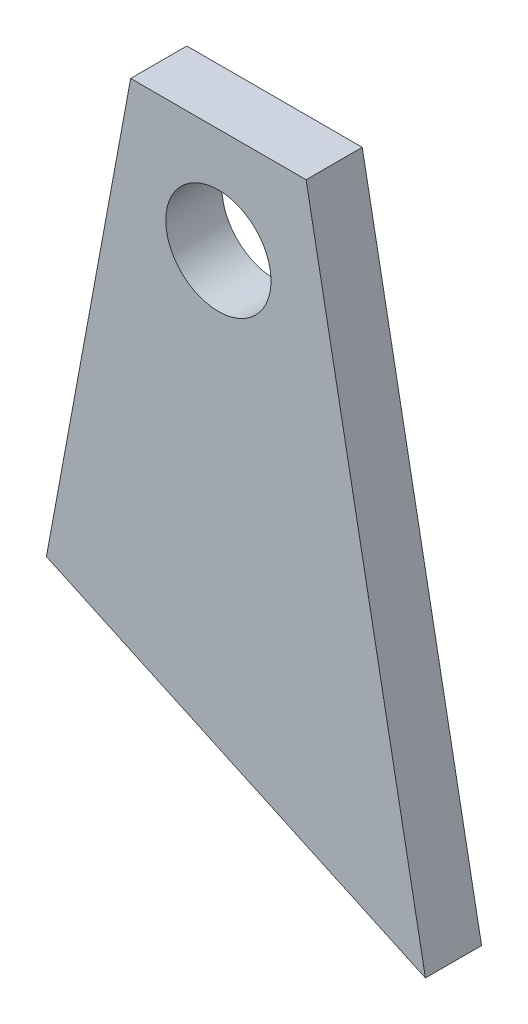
ISO-10303-21;
HEADER;
FILE_DESCRIPTION(('STEP AP214'),'2;1');
FILE_NAME('part.step','',(''),(''),'','','');
FILE_SCHEMA(('AUTOMOTIVE_DESIGN { 1 0 10303 214 1 1 1 1 }'));
ENDSEC;
DATA;
#1=APPLICATION_CONTEXT('core data for automotive mechanical design processes');
#2=APPLICATION_PROTOCOL_DEFINITION('international standard','automotive_design',2000,#1);
#3=PRODUCT_CONTEXT('',#1,'mechanical');
#4=PRODUCT('Part','Part','',(#3));
#5=PRODUCT_RELATED_PRODUCT_CATEGORY('part','',(#4));
#6=PRODUCT_DEFINITION_FORMATION('','',#4);
#7=PRODUCT_DEFINITION_CONTEXT('part definition',#1,'design');
#8=PRODUCT_DEFINITION('design','',#6,#7);
#9=PRODUCT_DEFINITION_SHAPE('','',#8);
#10=(LENGTH_UNIT() NAMED_UNIT(*) SI_UNIT(.MILLI.,.METRE.));
#11=(NAMED_UNIT(*) PLANE_ANGLE_UNIT() SI_UNIT($,.RADIAN.));
#12=(NAMED_UNIT(*) SI_UNIT($,.STERADIAN.) SOLID_ANGLE_UNIT());
#13=UNCERTAINTY_MEASURE_WITH_UNIT(LENGTH_MEASURE(1.E-05),#10,'distance_accuracy_value','');
#14=(GEOMETRIC_REPRESENTATION_CONTEXT(3) GLOBAL_UNCERTAINTY_ASSIGNED_CONTEXT((#13)) GLOBAL_UNIT_ASSIGNED_CONTEXT((#10,
#11,#12)) REPRESENTATION_CONTEXT('',''));
#15=CARTESIAN_POINT('',(0.,0.,0.));
#16=DIRECTION('',(0.,0.,1.));
#17=DIRECTION('',(1.,0.,0.));
#18=AXIS2_PLACEMENT_3D('',#15,#16,#17);
#19=CARTESIAN_POINT('',(-25.0000000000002,0.,16.));
#20=DIRECTION('',(0.,0.,-1.));
#21=DIRECTION('',(-1.,0.,0.));
#22=AXIS2_PLACEMENT_3D('',#19,#20,#21);
#23=PLANE('',#22);
#24=DIRECTION('',(-0.181547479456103,-0.983382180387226,0.));
#25=VECTOR('',#24,1.);
#26=CARTESIAN_POINT('',(-49.0000000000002,-130.,16.0000000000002));
#27=LINE('',#26,#25);
#28=CARTESIAN_POINT('',(-25.0000000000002,0.,16.));
#29=VERTEX_POINT('',#28);
#30=CARTESIAN_POINT('',(-49.0000000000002,-130.,16.0000000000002));
#31=VERTEX_POINT('',#30);
#32=EDGE_CURVE('E110',#29,#31,#27,.T.);
#33=ORIENTED_EDGE('',*,*,#32,.T.);
#34=DIRECTION('',(0.907466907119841,-0.420123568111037,0.));
#35=VECTOR('',#34,1.);
#36=CARTESIAN_POINT('',(59.,-180.,16.));
#37=LINE('',#36,#35);
#38=CARTESIAN_POINT('',(59.,-180.,16.));
#39=VERTEX_POINT('',#38);
#40=EDGE_CURVE('E95',#31,#39,#37,.T.);
#41=ORIENTED_EDGE('',*,*,#40,.T.);
#42=DIRECTION('',(-0.185606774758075,0.982624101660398,0.));
#43=VECTOR('',#42,1.);
#44=CARTESIAN_POINT('',(24.9999999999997,0.,16.));
#45=LINE('',#44,#43);
#46=CARTESIAN_POINT('',(24.9999999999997,0.,16.));
#47=VERTEX_POINT('',#46);
#48=EDGE_CURVE('E61',#39,#47,#45,.T.);
#49=ORIENTED_EDGE('',*,*,#48,.T.);
#50=DIRECTION('',(-1.,0.,0.));
#51=VECTOR('',#50,1.);
#52=CARTESIAN_POINT('',(-25.0000000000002,0.,16.));
#53=LINE('',#52,#51);
#54=EDGE_CURVE('E56',#47,#29,#53,.T.);
#55=ORIENTED_EDGE('',*,*,#54,.T.);
#56=EDGE_LOOP('',(#33,#41,#49,#55));
#57=FACE_BOUND('',#56,.T.);
#58=CARTESIAN_POINT('',(-1.11022302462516E-13,-29.9999999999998,16.));
#59=DIRECTION('',(0.,0.,1.));
#60=DIRECTION('',(1.,0.,0.));
#61=AXIS2_PLACEMENT_3D('',#58,#59,#60);
#62=CIRCLE('',#61,15.);
#63=CARTESIAN_POINT('',(-15.0000000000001,-29.9999999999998,16.));
#64=VERTEX_POINT('',#63);
#65=EDGE_CURVE('E100',#64,#64,#62,.T.);
#66=ORIENTED_EDGE('',*,*,#65,.F.);
#67=EDGE_LOOP('',(#66));
#68=FACE_BOUND('',#67,.T.);
#69=ADVANCED_FACE('F41',(#57,#68),#23,.F.);
#70=CARTESIAN_POINT('',(-25.0000000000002,0.,0.));
#71=DIRECTION('',(0.,0.,-1.));
#72=DIRECTION('',(-1.,0.,0.));
#73=AXIS2_PLACEMENT_3D('',#70,#71,#72);
#74=PLANE('',#73);
#75=DIRECTION('',(-0.181547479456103,-0.983382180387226,0.));
#76=VECTOR('',#75,1.);
#77=CARTESIAN_POINT('',(-49.0000000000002,-130.,2.22044604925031E-13));
#78=LINE('',#77,#76);
#79=CARTESIAN_POINT('',(-25.0000000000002,0.,0.));
#80=VERTEX_POINT('',#79);
#81=CARTESIAN_POINT('',(-49.0000000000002,-130.,2.22044604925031E-13));
#82=VERTEX_POINT('',#81);
#83=EDGE_CURVE('E87',#80,#82,#78,.T.);
#84=ORIENTED_EDGE('',*,*,#83,.F.);
#85=DIRECTION('',(-1.,0.,0.));
#86=VECTOR('',#85,1.);
#87=CARTESIAN_POINT('',(-25.0000000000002,0.,0.));
#88=LINE('',#87,#86);
#89=CARTESIAN_POINT('',(24.9999999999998,0.,0.));
#90=VERTEX_POINT('',#89);
#91=EDGE_CURVE('E108',#90,#80,#88,.T.);
#92=ORIENTED_EDGE('',*,*,#91,.F.);
#93=DIRECTION('',(-0.185606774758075,0.982624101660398,0.));
#94=VECTOR('',#93,1.);
#95=CARTESIAN_POINT('',(24.9999999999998,0.,0.));
#96=LINE('',#95,#94);
#97=CARTESIAN_POINT('',(59.,-180.,0.));
#98=VERTEX_POINT('',#97);
#99=EDGE_CURVE('E88',#98,#90,#96,.T.);
#100=ORIENTED_EDGE('',*,*,#99,.F.);
#101=DIRECTION('',(0.907466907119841,-0.420123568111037,0.));
#102=VECTOR('',#101,1.);
#103=CARTESIAN_POINT('',(59.,-180.,0.));
#104=LINE('',#103,#102);
#105=EDGE_CURVE('E82',#82,#98,#104,.T.);
#106=ORIENTED_EDGE('',*,*,#105,.F.);
#107=EDGE_LOOP('',(#84,#92,#100,#106));
#108=FACE_BOUND('',#107,.T.);
#109=CARTESIAN_POINT('',(-1.11022302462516E-13,-29.9999999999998,0.));
#110=DIRECTION('',(0.,0.,1.));
#111=DIRECTION('',(1.,0.,0.));
#112=AXIS2_PLACEMENT_3D('',#109,#110,#111);
#113=CIRCLE('',#112,15.);
#114=CARTESIAN_POINT('',(-15.0000000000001,-29.9999999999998,0.));
#115=VERTEX_POINT('',#114);
#116=EDGE_CURVE('E103',#115,#115,#113,.T.);
#117=ORIENTED_EDGE('',*,*,#116,.T.);
#118=EDGE_LOOP('',(#117));
#119=FACE_BOUND('',#118,.T.);
#120=ADVANCED_FACE('F83',(#108,#119),#74,.T.);
#121=CARTESIAN_POINT('',(-49.0000000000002,-130.,16.0000000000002));
#122=DIRECTION('',(0.983382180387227,-0.181547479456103,0.));
#123=DIRECTION('',(0.181547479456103,0.983382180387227,0.));
#124=AXIS2_PLACEMENT_3D('',#121,#122,#123);
#125=PLANE('',#124);
#126=ORIENTED_EDGE('',*,*,#83,.T.);
#127=DIRECTION('',(0.,0.,-1.));
#128=VECTOR('',#127,1.);
#129=CARTESIAN_POINT('',(-49.0000000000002,-130.,16.0000000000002));
#130=LINE('',#129,#128);
#131=EDGE_CURVE('E11',#31,#82,#130,.T.);
#132=ORIENTED_EDGE('',*,*,#131,.F.);
#133=ORIENTED_EDGE('',*,*,#32,.F.);
#134=DIRECTION('',(0.,0.,-1.));
#135=VECTOR('',#134,1.);
#136=CARTESIAN_POINT('',(-25.0000000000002,0.,16.));
#137=LINE('',#136,#135);
#138=EDGE_CURVE('E99',#29,#80,#137,.T.);
#139=ORIENTED_EDGE('',*,*,#138,.T.);
#140=EDGE_LOOP('',(#126,#132,#133,#139));
#141=FACE_BOUND('',#140,.T.);
#142=ADVANCED_FACE('F43',(#141),#125,.F.);
#143=CARTESIAN_POINT('',(59.,-180.,16.));
#144=DIRECTION('',(0.420123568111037,0.907466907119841,0.));
#145=DIRECTION('',(-0.907466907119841,0.420123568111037,0.));
#146=AXIS2_PLACEMENT_3D('',#143,#144,#145);
#147=PLANE('',#146);
#148=ORIENTED_EDGE('',*,*,#105,.T.);
#149=DIRECTION('',(0.,0.,-1.));
#150=VECTOR('',#149,1.);
#151=CARTESIAN_POINT('',(59.,-180.,16.));
#152=LINE('',#151,#150);
#153=EDGE_CURVE('E49',#39,#98,#152,.T.);
#154=ORIENTED_EDGE('',*,*,#153,.F.);
#155=ORIENTED_EDGE('',*,*,#40,.F.);
#156=ORIENTED_EDGE('',*,*,#131,.T.);
#157=EDGE_LOOP('',(#148,#154,#155,#156));
#158=FACE_BOUND('',#157,.T.);
#159=ADVANCED_FACE('F94',(#158),#147,.F.);
#160=CARTESIAN_POINT('',(24.9999999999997,0.,16.));
#161=DIRECTION('',(-0.982624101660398,-0.185606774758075,0.));
#162=DIRECTION('',(0.185606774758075,-0.982624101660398,0.));
#163=AXIS2_PLACEMENT_3D('',#160,#161,#162);
#164=PLANE('',#163);
#165=ORIENTED_EDGE('',*,*,#99,.T.);
#166=DIRECTION('',(0.,0.,-1.));
#167=VECTOR('',#166,1.);
#168=CARTESIAN_POINT('',(24.9999999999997,0.,16.));
#169=LINE('',#168,#167);
#170=EDGE_CURVE('E116',#47,#90,#169,.T.);
#171=ORIENTED_EDGE('',*,*,#170,.F.);
#172=ORIENTED_EDGE('',*,*,#48,.F.);
#173=ORIENTED_EDGE('',*,*,#153,.T.);
#174=EDGE_LOOP('',(#165,#171,#172,#173));
#175=FACE_BOUND('',#174,.T.);
#176=ADVANCED_FACE('F119',(#175),#164,.F.);
#177=CARTESIAN_POINT('',(-25.0000000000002,0.,16.));
#178=DIRECTION('',(0.,-1.,0.));
#179=DIRECTION('',(0.,0.,-1.));
#180=AXIS2_PLACEMENT_3D('',#177,#178,#179);
#181=PLANE('',#180);
#182=ORIENTED_EDGE('',*,*,#91,.T.);
#183=ORIENTED_EDGE('',*,*,#138,.F.);
#184=ORIENTED_EDGE('',*,*,#54,.F.);
#185=ORIENTED_EDGE('',*,*,#170,.T.);
#186=EDGE_LOOP('',(#182,#183,#184,#185));
#187=FACE_BOUND('',#186,.T.);
#188=ADVANCED_FACE('F121',(#187),#181,.F.);
#189=CARTESIAN_POINT('',(-1.11022302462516E-13,-29.9999999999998,16.));
#190=DIRECTION('',(0.,0.,-1.));
#191=DIRECTION('',(-1.,0.,0.));
#192=AXIS2_PLACEMENT_3D('',#189,#190,#191);
#193=CYLINDRICAL_SURFACE('',#192,15.);
#194=CARTESIAN_POINT('',(-15.0000000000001,-29.9999999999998,16.));
#195=CARTESIAN_POINT('',(-15.0000000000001,-29.9999999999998,15.8333333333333));
#196=CARTESIAN_POINT('',(-15.0000000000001,-29.9999999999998,15.6666666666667));
#197=CARTESIAN_POINT('',(-15.0000000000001,-29.9999999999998,15.3333333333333));
#198=CARTESIAN_POINT('',(-15.0000000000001,-29.9999999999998,15.1666666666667));
#199=CARTESIAN_POINT('',(-15.0000000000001,-29.9999999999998,14.8333333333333));
#200=CARTESIAN_POINT('',(-15.0000000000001,-29.9999999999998,14.6666666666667));
#201=CARTESIAN_POINT('',(-15.0000000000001,-29.9999999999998,14.3333333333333));
#202=CARTESIAN_POINT('',(-15.0000000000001,-29.9999999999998,14.1666666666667));
#203=CARTESIAN_POINT('',(-15.0000000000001,-29.9999999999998,13.8333333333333));
#204=CARTESIAN_POINT('',(-15.0000000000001,-29.9999999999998,13.6666666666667));
#205=CARTESIAN_POINT('',(-15.0000000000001,-29.9999999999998,13.3333333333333));
#206=CARTESIAN_POINT('',(-15.0000000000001,-29.9999999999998,13.1666666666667));
#207=CARTESIAN_POINT('',(-15.0000000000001,-29.9999999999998,12.8333333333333));
#208=CARTESIAN_POINT('',(-15.0000000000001,-29.9999999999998,12.6666666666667));
#209=CARTESIAN_POINT('',(-15.0000000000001,-29.9999999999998,12.3333333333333));
#210=CARTESIAN_POINT('',(-15.0000000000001,-29.9999999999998,12.1666666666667));
#211=CARTESIAN_POINT('',(-15.0000000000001,-29.9999999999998,11.8333333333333));
#212=CARTESIAN_POINT('',(-15.0000000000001,-29.9999999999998,11.6666666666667));
#213=CARTESIAN_POINT('',(-15.0000000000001,-29.9999999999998,11.3333333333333));
#214=CARTESIAN_POINT('',(-15.0000000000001,-29.9999999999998,11.1666666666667));
#215=CARTESIAN_POINT('',(-15.0000000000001,-29.9999999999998,10.8333333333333));
#216=CARTESIAN_POINT('',(-15.0000000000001,-29.9999999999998,10.6666666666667));
#217=CARTESIAN_POINT('',(-15.0000000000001,-29.9999999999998,10.3333333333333));
#218=CARTESIAN_POINT('',(-15.0000000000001,-29.9999999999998,10.1666666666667));
#219=CARTESIAN_POINT('',(-15.0000000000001,-29.9999999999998,9.83333333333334));
#220=CARTESIAN_POINT('',(-15.0000000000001,-29.9999999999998,9.66666666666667));
#221=CARTESIAN_POINT('',(-15.0000000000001,-29.9999999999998,9.33333333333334));
#222=CARTESIAN_POINT('',(-15.0000000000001,-29.9999999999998,9.16666666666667));
#223=CARTESIAN_POINT('',(-15.0000000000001,-29.9999999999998,8.83333333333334));
#224=CARTESIAN_POINT('',(-15.0000000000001,-29.9999999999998,8.66666666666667));
#225=CARTESIAN_POINT('',(-15.0000000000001,-29.9999999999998,8.33333333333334));
#226=CARTESIAN_POINT('',(-15.0000000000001,-29.9999999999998,8.16666666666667));
#227=CARTESIAN_POINT('',(-15.0000000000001,-29.9999999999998,7.83333333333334));
#228=CARTESIAN_POINT('',(-15.0000000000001,-29.9999999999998,7.66666666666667));
#229=CARTESIAN_POINT('',(-15.0000000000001,-29.9999999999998,7.33333333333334));
#230=CARTESIAN_POINT('',(-15.0000000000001,-29.9999999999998,7.16666666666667));
#231=CARTESIAN_POINT('',(-15.0000000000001,-29.9999999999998,6.83333333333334));
#232=CARTESIAN_POINT('',(-15.0000000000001,-29.9999999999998,6.66666666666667));
#233=CARTESIAN_POINT('',(-15.0000000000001,-29.9999999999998,6.33333333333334));
#234=CARTESIAN_POINT('',(-15.0000000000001,-29.9999999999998,6.16666666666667));
#235=CARTESIAN_POINT('',(-15.0000000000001,-29.9999999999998,5.83333333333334));
#236=CARTESIAN_POINT('',(-15.0000000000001,-29.9999999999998,5.66666666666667));
#237=CARTESIAN_POINT('',(-15.0000000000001,-29.9999999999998,5.33333333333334));
#238=CARTESIAN_POINT('',(-15.0000000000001,-29.9999999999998,5.16666666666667));
#239=CARTESIAN_POINT('',(-15.0000000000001,-29.9999999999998,4.83333333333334));
#240=CARTESIAN_POINT('',(-15.0000000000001,-29.9999999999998,4.66666666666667));
#241=CARTESIAN_POINT('',(-15.0000000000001,-29.9999999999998,4.33333333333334));
#242=CARTESIAN_POINT('',(-15.0000000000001,-29.9999999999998,4.16666666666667));
#243=CARTESIAN_POINT('',(-15.0000000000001,-29.9999999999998,3.83333333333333));
#244=CARTESIAN_POINT('',(-15.0000000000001,-29.9999999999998,3.66666666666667));
#245=CARTESIAN_POINT('',(-15.0000000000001,-29.9999999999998,3.33333333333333));
#246=CARTESIAN_POINT('',(-15.0000000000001,-29.9999999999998,3.16666666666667));
#247=CARTESIAN_POINT('',(-15.0000000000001,-29.9999999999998,2.83333333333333));
#248=CARTESIAN_POINT('',(-15.0000000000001,-29.9999999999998,2.66666666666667));
#249=CARTESIAN_POINT('',(-15.0000000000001,-29.9999999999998,2.33333333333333));
#250=CARTESIAN_POINT('',(-15.0000000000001,-29.9999999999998,2.16666666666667));
#251=CARTESIAN_POINT('',(-15.0000000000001,-29.9999999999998,1.83333333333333));
#252=CARTESIAN_POINT('',(-15.0000000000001,-29.9999999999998,1.66666666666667));
#253=CARTESIAN_POINT('',(-15.0000000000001,-29.9999999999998,1.33333333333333));
#254=CARTESIAN_POINT('',(-15.0000000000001,-29.9999999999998,1.16666666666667));
#255=CARTESIAN_POINT('',(-15.0000000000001,-29.9999999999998,0.833333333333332));
#256=CARTESIAN_POINT('',(-15.0000000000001,-29.9999999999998,0.666666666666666));
#257=CARTESIAN_POINT('',(-15.0000000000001,-29.9999999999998,0.333333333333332));
#258=CARTESIAN_POINT('',(-15.0000000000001,-29.9999999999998,0.166666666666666));
#259=CARTESIAN_POINT('',(-15.0000000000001,-29.9999999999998,0.));
#260=B_SPLINE_CURVE_WITH_KNOTS('',3,(#194,#195,#196,#197,#198,#199,#200,#201,#202,#203,#204,
#205,#206,#207,#208,#209,#210,#211,#212,#213,#214,#215,#216,#217,#218,#219,#220,#221,#222,#223,
#224,#225,#226,#227,#228,#229,#230,#231,#232,#233,#234,#235,#236,#237,#238,#239,#240,#241,#242,
#243,#244,#245,#246,#247,#248,#249,#250,#251,#252,#253,#254,#255,#256,#257,#258,#259),
.UNSPECIFIED.,.F.,.F.,(4,2,2,2,2,2,2,2,2,2,2,2,2,2,2,2,2,2,2,2,2,2,2,2,2,2,2,2,2,2,2,2,4),(0.,
0.500000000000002,1.,1.5,2.,2.5,3.,3.5,4.00000000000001,4.50000000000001,5.,5.50000000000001,
6.00000000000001,6.50000000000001,7.00000000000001,7.50000000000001,8.00000000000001,
8.50000000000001,9.00000000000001,9.50000000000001,10.,10.5,11.,11.5,12.,12.5,13.,13.5,14.,14.5,
15.,15.5,16.),.UNSPECIFIED.);
#261=EDGE_CURVE('BSEAM127',#64,#115,#260,.T.);
#262=ORIENTED_EDGE('',*,*,#65,.T.);
#263=ORIENTED_EDGE('',*,*,#116,.F.);
#264=ORIENTED_EDGE('',*,*,#261,.T.);
#265=ORIENTED_EDGE('',*,*,#261,.F.);
#266=EDGE_LOOP('',(#262,#264,#263,#265));
#267=FACE_BOUND('',#266,.T.);
#268=ADVANCED_FACE('F127',(#267),#193,.F.);
#269=CLOSED_SHELL('',(#69,#120,#142,#159,#176,#188,#268));
#270=MANIFOLD_SOLID_BREP('B2',#269);
#271=ADVANCED_BREP_SHAPE_REPRESENTATION('',(#18,#270),#14);
#272=SHAPE_DEFINITION_REPRESENTATION(#9,#271);
ENDSEC;
END-ISO-10303-21;
